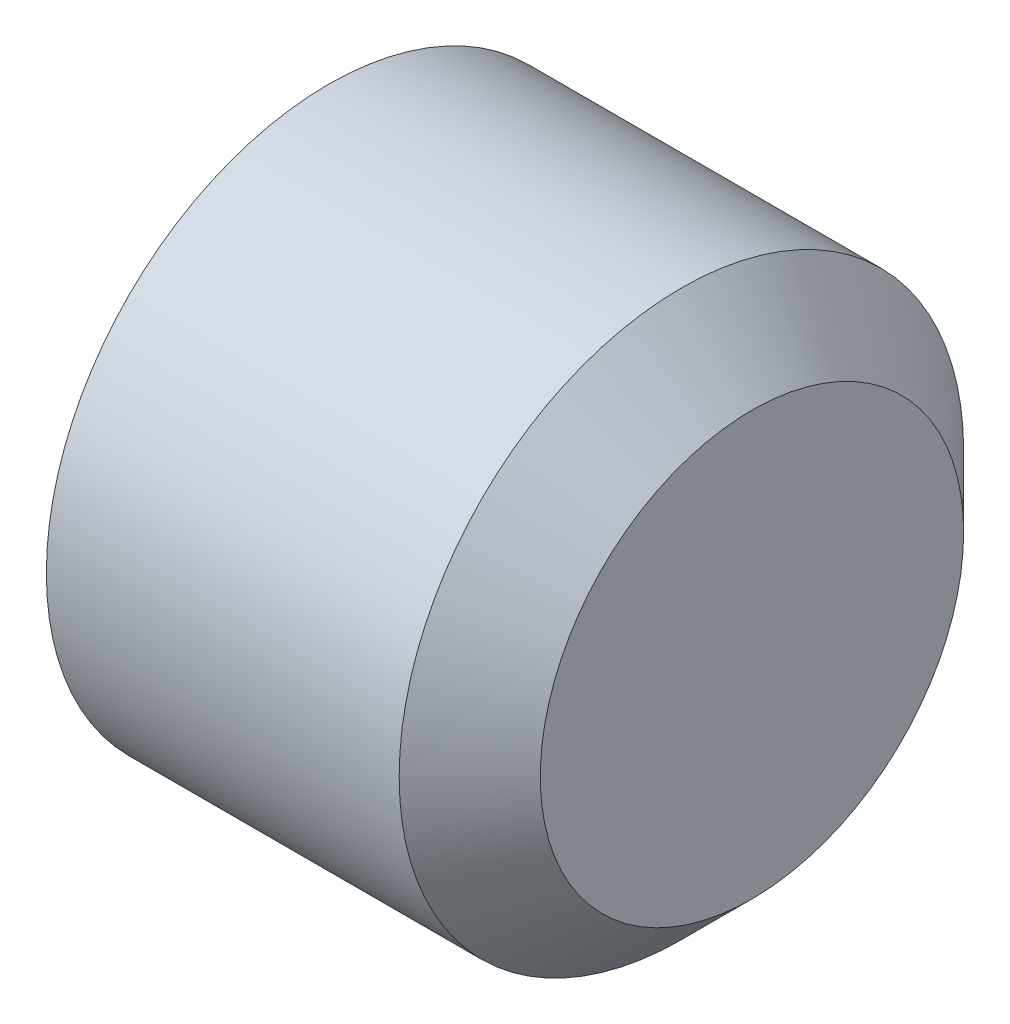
ISO-10303-21;
HEADER;
FILE_DESCRIPTION(('STEP AP214'),'2;1');
FILE_NAME('part.step','',(''),(''),'','','');
FILE_SCHEMA(('AUTOMOTIVE_DESIGN { 1 0 10303 214 1 1 1 1 }'));
ENDSEC;
DATA;
#1=APPLICATION_CONTEXT('core data for automotive mechanical design processes');
#2=APPLICATION_PROTOCOL_DEFINITION('international standard','automotive_design',2000,#1);
#3=PRODUCT_CONTEXT('',#1,'mechanical');
#4=PRODUCT('Part','Part','',(#3));
#5=PRODUCT_RELATED_PRODUCT_CATEGORY('part','',(#4));
#6=PRODUCT_DEFINITION_FORMATION('','',#4);
#7=PRODUCT_DEFINITION_CONTEXT('part definition',#1,'design');
#8=PRODUCT_DEFINITION('design','',#6,#7);
#9=PRODUCT_DEFINITION_SHAPE('','',#8);
#10=(LENGTH_UNIT() NAMED_UNIT(*) SI_UNIT(.MILLI.,.METRE.));
#11=(NAMED_UNIT(*) PLANE_ANGLE_UNIT() SI_UNIT($,.RADIAN.));
#12=(NAMED_UNIT(*) SI_UNIT($,.STERADIAN.) SOLID_ANGLE_UNIT());
#13=UNCERTAINTY_MEASURE_WITH_UNIT(LENGTH_MEASURE(1.E-05),#10,'distance_accuracy_value','');
#14=(GEOMETRIC_REPRESENTATION_CONTEXT(3) GLOBAL_UNCERTAINTY_ASSIGNED_CONTEXT((#13)) GLOBAL_UNIT_ASSIGNED_CONTEXT((#10,
#11,#12)) REPRESENTATION_CONTEXT('',''));
#15=CARTESIAN_POINT('',(0.,0.,0.));
#16=DIRECTION('',(0.,0.,1.));
#17=DIRECTION('',(1.,0.,0.));
#18=AXIS2_PLACEMENT_3D('',#15,#16,#17);
#19=CARTESIAN_POINT('',(0.,0.,0.));
#20=DIRECTION('',(1.,0.,0.));
#21=DIRECTION('',(0.,0.,-1.));
#22=AXIS2_PLACEMENT_3D('',#19,#20,#21);
#23=CYLINDRICAL_SURFACE('',#22,2.);
#24=CARTESIAN_POINT('',(0.,0.,0.));
#25=DIRECTION('',(1.,0.,0.));
#26=DIRECTION('',(0.,0.,-1.));
#27=AXIS2_PLACEMENT_3D('',#24,#25,#26);
#28=CIRCLE('',#27,2.);
#29=CARTESIAN_POINT('',(0.,-1.27231558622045E-13,-2.));
#30=VERTEX_POINT('',#29);
#31=EDGE_CURVE('E12',#30,#30,#28,.T.);
#32=ORIENTED_EDGE('',*,*,#31,.T.);
#33=EDGE_LOOP('',(#32));
#34=FACE_BOUND('',#33,.T.);
#35=CARTESIAN_POINT('',(2.5,0.,0.));
#36=DIRECTION('',(1.,0.,0.));
#37=DIRECTION('',(0.,0.,-1.));
#38=AXIS2_PLACEMENT_3D('',#35,#36,#37);
#39=CIRCLE('',#38,2.);
#40=CARTESIAN_POINT('',(2.5,-1.27231558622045E-13,-2.));
#41=VERTEX_POINT('',#40);
#42=EDGE_CURVE('E48',#41,#41,#39,.T.);
#43=ORIENTED_EDGE('',*,*,#42,.F.);
#44=EDGE_LOOP('',(#43));
#45=FACE_BOUND('',#44,.T.);
#46=ADVANCED_FACE('F38',(#34,#45),#23,.T.);
#47=CARTESIAN_POINT('',(-4.16333634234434E-13,2.0000000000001,0.));
#48=DIRECTION('',(-1.,0.,0.));
#49=DIRECTION('',(0.,0.,1.));
#50=AXIS2_PLACEMENT_3D('',#47,#48,#49);
#51=PLANE('',#50);
#52=ORIENTED_EDGE('',*,*,#31,.F.);
#53=EDGE_LOOP('',(#52));
#54=FACE_BOUND('',#53,.T.);
#55=ADVANCED_FACE('F59',(#54),#51,.T.);
#56=CARTESIAN_POINT('',(3.,0.,0.));
#57=DIRECTION('',(1.,0.,0.));
#58=DIRECTION('',(0.,0.,-1.));
#59=AXIS2_PLACEMENT_3D('',#56,#57,#58);
#60=PLANE('',#59);
#61=CARTESIAN_POINT('',(3.,0.,0.));
#62=DIRECTION('',(1.,0.,0.));
#63=DIRECTION('',(0.,0.,-1.));
#64=AXIS2_PLACEMENT_3D('',#61,#62,#63);
#65=CIRCLE('',#64,1.5);
#66=CARTESIAN_POINT('',(3.,0.,-1.5));
#67=VERTEX_POINT('',#66);
#68=EDGE_CURVE('E44',#67,#67,#65,.T.);
#69=ORIENTED_EDGE('',*,*,#68,.T.);
#70=EDGE_LOOP('',(#69));
#71=FACE_BOUND('',#70,.T.);
#72=ADVANCED_FACE('F63',(#71),#60,.T.);
#73=CARTESIAN_POINT('',(3.,0.,0.));
#74=DIRECTION('',(-1.,0.,0.));
#75=DIRECTION('',(0.,0.,1.));
#76=AXIS2_PLACEMENT_3D('',#73,#74,#75);
#77=CONICAL_SURFACE('',#76,1.5,0.785398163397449);
#78=ORIENTED_EDGE('',*,*,#42,.T.);
#79=EDGE_LOOP('',(#78));
#80=FACE_BOUND('',#79,.T.);
#81=ORIENTED_EDGE('',*,*,#68,.F.);
#82=EDGE_LOOP('',(#81));
#83=FACE_BOUND('',#82,.T.);
#84=ADVANCED_FACE('F55',(#80,#83),#77,.T.);
#85=CLOSED_SHELL('',(#46,#55,#72,#84));
#86=MANIFOLD_SOLID_BREP('B2',#85);
#87=ADVANCED_BREP_SHAPE_REPRESENTATION('',(#18,#86),#14);
#88=SHAPE_DEFINITION_REPRESENTATION(#9,#87);
ENDSEC;
END-ISO-10303-21;
